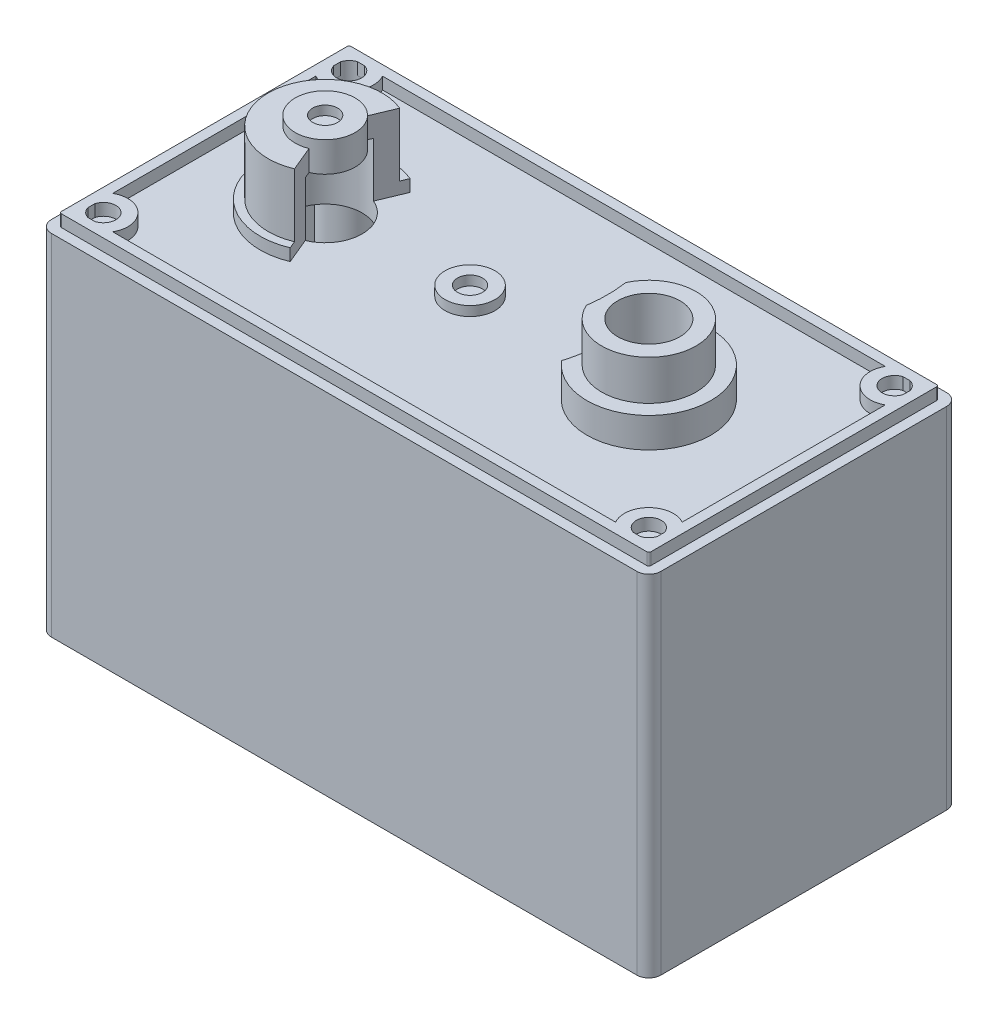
from build123d import *

# Parameters (mm, degrees)
SKETCH1_R                       = 2.3495
SKETCH1_R_2                     = 1.9812
EXTRUDE1_DEPTH                  = 1.190625
SKETCH6_R                       = 1.5875
SKETCH6_R_2                     = 0.79375
EXTRUDE3_DEPTH                  = 0.6096
SKETCH7_R                       = 3
SKETCH7_R_2                     = 1.9812
EXTRUDE4_DEPTH                  = 4.445
SKETCH16_R                      = 3.937
SKETCH16_R_2                    = 3
EXTRUDE11_DEPTH                 = 1.905
CUT_EXTRUDE1_REACH              = 24.444
SKETCH11_R                      = 7.874
SKETCH11_R_2                    = 6.604
EXTRUDE6_DEPTH                  = 4.572
EXTRUDE5_START                  = 22.225
SKETCH10_W                      = 37.211
SKETCH10_H                      = 18.161
EXTRUDE5_DEPTH                  = 22.225
SKETCH13_W                      = 1.143
SKETCH13_H                      = 3.048
EXTRUDE8_DEPTH                  = 10.795
EXTRUDE9_START                  = -1.952625
SKETCH14_R                      = 0.79375
EXTRUDE9_DEPTH                  = 22.987
SKETCH23_R                      = 0.79375
CUT_EXTRUDE2_DEPTH              = 1.190625
CUT_EXTRUDE3_REACH              = 36.655
MIRROR2_START                   = -1.952625
MIRROR2_COPY_1_SKETCH_R         = 0.79375
MIRROR2_COPY_1_DEPTH            = 22.987
SKETCH18_W                      = 36.195
SKETCH18_H                      = 17.145
EXTRUDE12_DEPTH                 = 0.762
SKETCH19_R                      = 2.54
EXTRUDE13_DEPTH                 = 1.905
EXTRUDE14_DEPTH                 = 5.588
F_1_64_TAPPED_HOLE1_D           = 1.5113
F_1_64_TAPPED_HOLE1_DEPTH       = 5.588
F_1_64_TAPPED_HOLE1_CBORE_D     = 1.8542
F_1_64_TAPPED_HOLE1_CBORE_DEPTH = 3.7084


with BuildPart() as part:
    # Sketch1 → Extrude1 (new body)
    with BuildSketch(Plane(origin=(0, 0, 0), x_dir=(1, 0, 0), z_dir=(0, 1, 0))):
        with BuildLine():
            Line((-18.6055, 9.8425), (18.6055, 9.8425))
            ThreePointArc((18.6055, 9.8425), (19.144315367, 9.619315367), (19.3675, 9.0805))
            Line((19.3675, 9.0805), (19.3675, -9.0805))
            ThreePointArc((19.3675, -9.0805), (19.144315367, -9.619315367), (18.6055, -9.8425))
            Line((18.6055, -9.8425), (-18.6055, -9.8425))
            ThreePointArc((-18.6055, -9.8425), (-19.144315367, -9.619315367), (-19.3675, -9.0805))
            Line((-19.3675, -9.0805), (-19.3675, 9.0805))
            ThreePointArc((-19.3675, 9.0805), (-19.144315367, 9.619315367), (-18.6055, 9.8425))
        make_face()
        with Locations(Location((-11.049, 0, 0), (0, 0, 90))):
            Circle(SKETCH1_R, mode=Mode.SUBTRACT)
        with Locations(Location((9.525, 0, 0), (0, 0, 90))):
            Circle(SKETCH1_R_2, mode=Mode.SUBTRACT)
    extrude(amount=EXTRUDE1_DEPTH)

    # Sketch6 → Extrude3 (add)
    with BuildSketch(Plane(origin=(0, 1.190625, 0), x_dir=(-1, 0, 0), z_dir=(0, 1, 0))):
        with Locations(Location((1.8415, 0, 0), (0, 0, 270))):
            Circle(SKETCH6_R)
        with Locations(Location((1.8415, 0, 0), (0, 0, 90))):
            Circle(SKETCH6_R_2, mode=Mode.SUBTRACT)
    extrude(amount=EXTRUDE3_DEPTH)

    # Sketch7 → Extrude4 (add)
    with BuildSketch(Plane(origin=(0, 1.190625, 0), x_dir=(-1, 0, 0), z_dir=(0, 1, 0))):
        with Locations(Location((-9.525, 0, 0), (0, 0, 270))):
            Circle(SKETCH7_R)
        with Locations(Location((-9.525, 0, 0), (0, 0, 270))):
            Circle(SKETCH7_R_2, mode=Mode.SUBTRACT)
    extrude(amount=EXTRUDE4_DEPTH)

    # Sketch16 → Extrude11 (add)
    with BuildSketch(Plane(origin=(0, 1.190625, 0), x_dir=(-1, 0, 0), z_dir=(0, 1, 0))):
        with Locations(Location((-9.525, 0, 0), (0, 0, 270))):
            Circle(SKETCH16_R)
        with Locations(Location((-9.525, 0, 0), (0, 0, 90))):
            Circle(SKETCH16_R_2, mode=Mode.SUBTRACT)
    extrude(amount=EXTRUDE11_DEPTH)

    # Cut-Extrude1: up to this face of the body (flat: up to its plane)
    cut_extrude1_end = Plane(part.part.faces().sort_by_distance((0, 1.190625, -9.408000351))[0])
    # Sketch17 → Cut-Extrude1 (cut, up to the picked face)
    with BuildSketch(Plane(origin=(0, 5.635625, 0), x_dir=(-1, 0, 0), z_dir=(0, 1, 0)), mode=Mode.PRIVATE) as cut_extrude1_sk1:
        with BuildLine():
            ThreePointArc((-6.516949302, 2.54), (-6.894361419, 0), (-6.516949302, -2.54))
            ThreePointArc((-6.516949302, -2.54), (-5.588, 0), (-6.516949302, 2.54))
        make_face()
    cut_extrude1_tool1 = split(extrude(cut_extrude1_sk1.sketch, amount=-CUT_EXTRUDE1_REACH, mode=Mode.PRIVATE), bisect_by=cut_extrude1_end, keep=Keep.BOTH, mode=Mode.PRIVATE)
    add(cut_extrude1_tool1.solids().sort_by(Axis((6.291228, 5.635625, 0), (0, -1, 0)))[0], mode=Mode.SUBTRACT)

    # Sketch11 → Extrude6 (add)
    with BuildSketch(Plane.XZ):
        with Locations(Location((9.525, 0, 0), (0, 0, 270))):
            Circle(SKETCH11_R)
        with Locations(Location((9.525, 0, 0), (0, 0, 270))):
            Circle(SKETCH11_R_2, mode=Mode.SUBTRACT)
    extrude(amount=EXTRUDE6_DEPTH)

    # Sketch10 → Extrude5 (add)
    with BuildSketch(Plane.XZ.offset(-1.190625).offset(EXTRUDE5_START)):
        with BuildLine():
            Line((-19.3675, 9.0805), (-19.3675, -9.0805))
            ThreePointArc((-19.3675, -9.0805), (-19.144315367, -9.619315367), (-18.6055, -9.8425))
            Line((-18.6055, -9.8425), (18.6055, -9.8425))
            ThreePointArc((18.6055, -9.8425), (19.144315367, -9.619315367), (19.3675, -9.0805))
            Line((19.3675, -9.0805), (19.3675, 9.0805))
            ThreePointArc((19.3675, 9.0805), (19.144315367, 9.619315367), (18.6055, 9.8425))
            Line((18.6055, 9.8425), (-18.6055, 9.8425))
            ThreePointArc((-18.6055, 9.8425), (-19.144315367, 9.619315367), (-19.3675, 9.0805))
        make_face()
        Rectangle(SKETCH10_W, SKETCH10_H, mode=Mode.SUBTRACT)
    extrude(amount=-EXTRUDE5_DEPTH)

    # Sketch13 → Extrude8 (add)
    with BuildSketch(Plane.XZ):
        with BuildLine():
            Line((-5.9055, 6.0325), (-5.9055, 9.0805))
            Line((-5.9055, 9.0805), (-4.7625, 9.0805))
            Line((-4.7625, 9.0805), (-4.7625, 6.713831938))
            ThreePointArc((-4.7625, 6.713831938), (-1.851412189, 0), (-4.7625, -6.713831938))
            Line((-4.7625, -6.713831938), (-4.7625, -9.0805))
            Line((-4.7625, -9.0805), (-5.9055, -9.0805))
            Line((-5.9055, -9.0805), (-5.9055, -6.0325))
            ThreePointArc((-5.9055, -6.0325), (-3.121412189, 0), (-5.9055, 6.0325))
        make_face()
        with Locations((-8.382, 7.5565)):
            Rectangle(SKETCH13_W, SKETCH13_H)
        with Locations((-13.335, 7.5565)):
            Rectangle(SKETCH13_W, SKETCH13_H)
        with Locations((-13.335, -7.5565)):
            Rectangle(SKETCH13_W, SKETCH13_H)
        with Locations((-8.382, -7.5565)):
            Rectangle(SKETCH13_W, SKETCH13_H)
    extrude(amount=EXTRUDE8_DEPTH)

    # Sketch14 → Extrude9 (add)
    with BuildSketch(Plane.XZ.offset(EXTRUDE9_START)):
        with BuildLine():
            Line((-18.6055, -9.0805), (-18.6055, -6.911913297))
            ThreePointArc((-18.6055, -6.911913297), (-16.235418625, -6.710418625), (-16.436913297, -9.0805))
            Line((-16.436913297, -9.0805), (-18.6055, -9.0805))
        make_face()
        with Locations(Location((-17.3355, -7.8105, 0), (0, 0, 270))):
            Circle(SKETCH14_R, mode=Mode.SUBTRACT)
    extrude9 = extrude(amount=EXTRUDE9_DEPTH)

    # Sketch23 → Cut-Extrude2 (cut)
    with BuildSketch(Plane(origin=(0, 1.190625, 0), x_dir=(-1, 0, 0), z_dir=(0, 1, 0))):
        with Locations(Location((17.3355, -7.8105, 0), (0, 0, 270))):
            Circle(SKETCH23_R)
    extrude(amount=-CUT_EXTRUDE2_DEPTH, mode=Mode.SUBTRACT)

    # Sketch9 → Revolve1 (revolve)
    with BuildSketch(Plane.XY, mode=Mode.PRIVATE) as revolve1_sk:
        Polygon((-12.954, 5.965825), (-12.954, 6.550025), (-11.84275, 6.550025), (-11.84275, 5.965825), (-11.049, 5.965825), (-11.049, 4.645025), (-13.3985, 4.645025), (-13.3985, 1.190625), (-15.1765, 1.190625), (-15.1765, 1.952625), (-14.6685, 1.952625), (-14.6685, 5.965825), align=None)
    revolve(revolve1_sk.sketch.rotate(Axis((-11.049, 0, 0), (0, 1, 0)), 270), axis=Axis((-11.049, 0, 0), (0, 1, 0)))

    # Cut-Extrude3: up to this face of the body (flat: up to its plane)
    cut_extrude3_end = Plane(part.part.faces().sort_by_distance((-1.8415, 1.190625, 0))[0])
    # Sketch24 → Cut-Extrude3 (cut, up to the picked face)
    with BuildSketch(Plane(origin=(0, 5.965825, 0), x_dir=(-1, 0, 0), z_dir=(0, 1, 0)), mode=Mode.PRIVATE) as cut_extrude3_sk1:
        with BuildLine():
            Line((10.316307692, 1.758461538), (9.4615, 3.81))
            ThreePointArc((9.4615, 3.81), (6.9215, 0), (9.4615, -3.81))
            Line((9.4615, -3.81), (10.316307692, -1.758461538))
            ThreePointArc((10.316307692, -1.758461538), (9.144, 0), (10.316307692, 1.758461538))
        make_face()
    cut_extrude3_tool1 = split(extrude(cut_extrude3_sk1.sketch, amount=-CUT_EXTRUDE3_REACH, mode=Mode.PRIVATE), bisect_by=cut_extrude3_end, keep=Keep.BOTH, mode=Mode.PRIVATE)
    add(cut_extrude3_tool1.solids().sort_by(Axis((-8.574349, 5.965825, 0), (0, -1, 0)))[0], mode=Mode.SUBTRACT)

    # Mirror1: Extrude9 across plane
    add(extrude9.mirror(Plane(origin=(0, 0, 0), x_dir=(0, 0, 1), z_dir=(1, 0, 0))))

    # Mirror2: Extrude9 across plane
    add(extrude9.mirror(Plane.XY))

    # Mirror2 copy 1 sketch → Mirror2 copy 1 (add)
    with BuildSketch(Plane(origin=(0, 0, 0), x_dir=(-1, 0, 0), z_dir=(0, -1, 0)).offset(MIRROR2_START)):
        with BuildLine():
            Line((-18.6055, -9.0805), (-18.6055, -6.911913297))
            ThreePointArc((-18.6055, -6.911913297), (-16.235418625, -6.710418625), (-16.436913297, -9.0805))
            Line((-16.436913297, -9.0805), (-18.6055, -9.0805))
        make_face()
        with Locations(Location((-17.3355, -7.8105, 0), (0, 0, 270))):
            Circle(MIRROR2_COPY_1_SKETCH_R, mode=Mode.SUBTRACT)
    extrude(amount=MIRROR2_COPY_1_DEPTH)

    # Sketch18 → Extrude12 (add)
    with BuildSketch(Plane(origin=(0, 1.952625, 0), x_dir=(-1, 0, 0), z_dir=(0, 1, 0))):
        with BuildLine():
            Line((18.6055, 9.2075), (-18.6055, 9.2075))
            ThreePointArc((-18.6055, 9.2075), (-18.695302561, 9.170302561), (-18.7325, 9.0805))
            Line((-18.7325, 9.0805), (-18.7325, -9.0805))
            ThreePointArc((-18.7325, -9.0805), (-18.695302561, -9.170302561), (-18.6055, -9.2075))
            Line((-18.6055, -9.2075), (18.6055, -9.2075))
            ThreePointArc((18.6055, -9.2075), (18.695302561, -9.170302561), (18.7325, -9.0805))
            Line((18.7325, -9.0805), (18.7325, 9.0805))
            ThreePointArc((18.7325, 9.0805), (18.695302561, 9.170302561), (18.6055, 9.2075))
        make_face()
        Rectangle(SKETCH18_W, SKETCH18_H, mode=Mode.SUBTRACT)
    extrude(amount=-EXTRUDE12_DEPTH)

    # Sketch19 → Extrude13 (add)
    with BuildSketch(Plane.XZ):
        with BuildLine():
            Line((11.557, -3.222898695), (11.557, -6.283612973))
            ThreePointArc((11.557, -6.283612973), (11.178939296, -6.393535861), (10.795, -6.480734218))
            Line((10.795, -6.480734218), (10.795, -3.592102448))
            ThreePointArc((10.795, -3.592102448), (9.525, -3.81), (8.255, -3.592102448))
            Line((8.255, -3.592102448), (8.255, -6.480734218))
            ThreePointArc((8.255, -6.480734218), (7.871060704, -6.393535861), (7.493, -6.283612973))
            Line((7.493, -6.283612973), (7.493, -3.222898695))
            ThreePointArc((7.493, -3.222898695), (9.525, 3.81), (11.557, -3.222898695))
        make_face()
        with Locations(Location((9.525, 0, 0), (0, 0, 90))):
            Circle(SKETCH19_R, mode=Mode.SUBTRACT)
    extrude(amount=EXTRUDE13_DEPTH)

    # Sketch20 → Extrude14 (add)
    with BuildSketch(Plane.XZ):
        with BuildLine():
            ThreePointArc((4.320531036, -4.065257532), (3.147336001, -7.413112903), (6.282470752, -5.753157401))
            ThreePointArc((6.282470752, -5.753157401), (5.218006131, -5.006258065), (4.320531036, -4.065257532))
        make_face()
    extrude(amount=EXTRUDE14_DEPTH)

    # 1-64 Tapped Hole1
    with Locations(Plane(origin=(4.389738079, -5.588, -5.969), x_dir=(0, 0, -1), z_dir=(0, -1, 0))):
        with Locations((0, 0)):
            CounterBoreHole(F_1_64_TAPPED_HOLE1_D / 2, F_1_64_TAPPED_HOLE1_CBORE_D / 2, F_1_64_TAPPED_HOLE1_CBORE_DEPTH, depth=F_1_64_TAPPED_HOLE1_DEPTH)


solid = part.part
